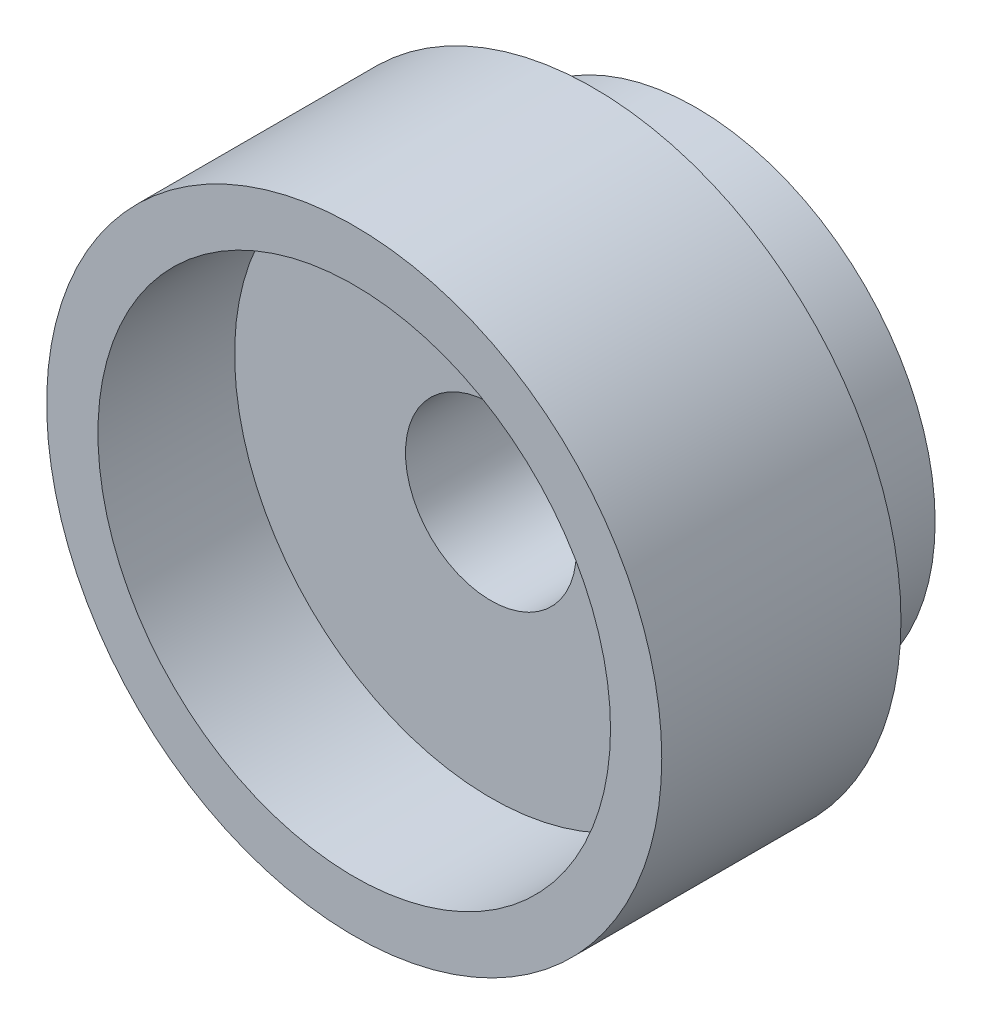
ISO-10303-21;
HEADER;
FILE_DESCRIPTION(('STEP AP214'),'2;1');
FILE_NAME('part.step','',(''),(''),'','','');
FILE_SCHEMA(('AUTOMOTIVE_DESIGN { 1 0 10303 214 1 1 1 1 }'));
ENDSEC;
DATA;
#1=APPLICATION_CONTEXT('core data for automotive mechanical design processes');
#2=APPLICATION_PROTOCOL_DEFINITION('international standard','automotive_design',2000,#1);
#3=PRODUCT_CONTEXT('',#1,'mechanical');
#4=PRODUCT('Part','Part','',(#3));
#5=PRODUCT_RELATED_PRODUCT_CATEGORY('part','',(#4));
#6=PRODUCT_DEFINITION_FORMATION('','',#4);
#7=PRODUCT_DEFINITION_CONTEXT('part definition',#1,'design');
#8=PRODUCT_DEFINITION('design','',#6,#7);
#9=PRODUCT_DEFINITION_SHAPE('','',#8);
#10=(LENGTH_UNIT() NAMED_UNIT(*) SI_UNIT(.MILLI.,.METRE.));
#11=(NAMED_UNIT(*) PLANE_ANGLE_UNIT() SI_UNIT($,.RADIAN.));
#12=(NAMED_UNIT(*) SI_UNIT($,.STERADIAN.) SOLID_ANGLE_UNIT());
#13=UNCERTAINTY_MEASURE_WITH_UNIT(LENGTH_MEASURE(1.E-05),#10,'distance_accuracy_value','');
#14=(GEOMETRIC_REPRESENTATION_CONTEXT(3) GLOBAL_UNCERTAINTY_ASSIGNED_CONTEXT((#13)) GLOBAL_UNIT_ASSIGNED_CONTEXT((#10,
#11,#12)) REPRESENTATION_CONTEXT('',''));
#15=CARTESIAN_POINT('',(0.,0.,0.));
#16=DIRECTION('',(0.,0.,1.));
#17=DIRECTION('',(1.,0.,0.));
#18=AXIS2_PLACEMENT_3D('',#15,#16,#17);
#19=CARTESIAN_POINT('',(0.,0.,20.));
#20=DIRECTION('',(0.,0.,1.));
#21=DIRECTION('',(1.,0.,0.));
#22=AXIS2_PLACEMENT_3D('',#19,#20,#21);
#23=CYLINDRICAL_SURFACE('',#22,14.);
#24=CARTESIAN_POINT('',(0.,0.,0.));
#25=DIRECTION('',(0.,0.,1.));
#26=DIRECTION('',(1.,0.,0.));
#27=AXIS2_PLACEMENT_3D('',#24,#25,#26);
#28=CIRCLE('',#27,14.);
#29=CARTESIAN_POINT('',(14.,0.,0.));
#30=VERTEX_POINT('',#29);
#31=EDGE_CURVE('E8',#30,#30,#28,.T.);
#32=ORIENTED_EDGE('',*,*,#31,.T.);
#33=EDGE_LOOP('',(#32));
#34=FACE_BOUND('',#33,.T.);
#35=CARTESIAN_POINT('',(0.,0.,6.));
#36=DIRECTION('',(0.,0.,1.));
#37=DIRECTION('',(1.,0.,0.));
#38=AXIS2_PLACEMENT_3D('',#35,#36,#37);
#39=CIRCLE('',#38,14.);
#40=CARTESIAN_POINT('',(14.,0.,6.));
#41=VERTEX_POINT('',#40);
#42=EDGE_CURVE('E25',#41,#41,#39,.T.);
#43=ORIENTED_EDGE('',*,*,#42,.F.);
#44=EDGE_LOOP('',(#43));
#45=FACE_BOUND('',#44,.T.);
#46=CARTESIAN_POINT('',(0.,14.,2.55));
#47=CARTESIAN_POINT('',(-0.0812137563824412,13.9999990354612,2.55000350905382));
#48=CARTESIAN_POINT('',(-0.162480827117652,13.9992858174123,2.55684608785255));
#49=CARTESIAN_POINT('',(-0.322760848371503,13.9965092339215,2.5840385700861));
#50=CARTESIAN_POINT('',(-0.401771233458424,13.9944443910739,2.60440325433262));
#51=CARTESIAN_POINT('',(-0.555193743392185,13.9891975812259,2.65803979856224));
#52=CARTESIAN_POINT('',(-0.629608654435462,13.9860162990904,2.69130374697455));
#53=CARTESIAN_POINT('',(-0.77178313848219,13.9788920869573,2.76977895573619));
#54=CARTESIAN_POINT('',(-0.839544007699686,13.9749493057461,2.81498788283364));
#55=CARTESIAN_POINT('',(-0.966763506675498,13.9667266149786,2.91625623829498));
#56=CARTESIAN_POINT('',(-1.02619293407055,13.9624455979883,2.97235226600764));
#57=CARTESIAN_POINT('',(-1.13481150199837,13.9540380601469,3.09372430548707));
#58=CARTESIAN_POINT('',(-1.18400016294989,13.9499115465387,3.15900074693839));
#59=CARTESIAN_POINT('',(-1.27084511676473,13.9422689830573,3.29706444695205));
#60=CARTESIAN_POINT('',(-1.3084748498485,13.9387543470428,3.36986849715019));
#61=CARTESIAN_POINT('',(-1.37096418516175,13.9327473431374,3.52080447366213));
#62=CARTESIAN_POINT('',(-1.39582412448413,13.930254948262,3.59893625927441));
#63=CARTESIAN_POINT('',(-1.43198129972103,13.9265847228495,3.75801120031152));
#64=CARTESIAN_POINT('',(-1.4433271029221,13.9254021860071,3.83894320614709));
#65=CARTESIAN_POINT('',(-1.45228409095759,13.9244709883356,4.00157070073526));
#66=CARTESIAN_POINT('',(-1.44989566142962,13.9247222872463,4.08326616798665));
#67=CARTESIAN_POINT('',(-1.43149199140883,13.9266260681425,4.244766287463));
#68=CARTESIAN_POINT('',(-1.41552984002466,13.9282730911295,4.32457706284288));
#69=CARTESIAN_POINT('',(-1.37051446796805,13.9327742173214,4.48038077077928));
#70=CARTESIAN_POINT('',(-1.3414610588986,13.9356283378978,4.55637364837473));
#71=CARTESIAN_POINT('',(-1.27102949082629,13.9422283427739,4.70255174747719));
#72=CARTESIAN_POINT('',(-1.22962784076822,13.9459759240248,4.77272557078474));
#73=CARTESIAN_POINT('',(-1.13569190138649,13.9539391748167,4.90514883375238));
#74=CARTESIAN_POINT('',(-1.08315726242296,13.9581548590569,4.96739802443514));
#75=CARTESIAN_POINT('',(-0.9681503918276,13.9666036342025,5.08251344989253));
#76=CARTESIAN_POINT('',(-0.905632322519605,13.9708367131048,5.13533390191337));
#77=CARTESIAN_POINT('',(-0.772592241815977,13.9788245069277,5.22973741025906));
#78=CARTESIAN_POINT('',(-0.702070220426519,13.9825792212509,5.27132045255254));
#79=CARTESIAN_POINT('',(-0.55499191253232,13.9891885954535,5.34206715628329));
#80=CARTESIAN_POINT('',(-0.478434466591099,13.9920430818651,5.37122842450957));
#81=CARTESIAN_POINT('',(-0.321473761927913,13.9965286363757,5.4162698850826));
#82=CARTESIAN_POINT('',(-0.241070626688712,13.9981597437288,5.43215050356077));
#83=CARTESIAN_POINT('',(-0.0790972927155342,14.0000097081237,5.45012162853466));
#84=CARTESIAN_POINT('',(0.00246582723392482,14.0002350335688,5.45227529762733));
#85=CARTESIAN_POINT('',(0.164791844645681,13.9992654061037,5.4428973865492));
#86=CARTESIAN_POINT('',(0.245554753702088,13.9980704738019,5.43136600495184));
#87=CARTESIAN_POINT('',(0.403804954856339,13.994398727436,5.39499773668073));
#88=CARTESIAN_POINT('',(0.481299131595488,13.9919247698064,5.37019049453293));
#89=CARTESIAN_POINT('',(0.631026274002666,13.9859724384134,5.30800520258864));
#90=CARTESIAN_POINT('',(0.703259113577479,13.9824940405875,5.27062685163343));
#91=CARTESIAN_POINT('',(0.840698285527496,13.9749056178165,5.18420422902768));
#92=CARTESIAN_POINT('',(0.905878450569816,13.9707933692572,5.13511854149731));
#93=CARTESIAN_POINT('',(1.02709699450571,13.9624056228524,5.02673388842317));
#94=CARTESIAN_POINT('',(1.08313512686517,13.9581301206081,4.9674346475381));
#95=CARTESIAN_POINT('',(1.18469882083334,13.9498782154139,4.84003022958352));
#96=CARTESIAN_POINT('',(1.23018287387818,13.9459030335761,4.77189187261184));
#97=CARTESIAN_POINT('',(1.30906175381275,13.9387206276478,4.6289067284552));
#98=CARTESIAN_POINT('',(1.34245675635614,13.9355133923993,4.55406003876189));
#99=CARTESIAN_POINT('',(1.39614037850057,13.9302377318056,4.39992411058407));
#100=CARTESIAN_POINT('',(1.41645352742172,13.9281671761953,4.3206434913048));
#101=CARTESIAN_POINT('',(1.44347634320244,13.9253927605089,4.15977417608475));
#102=CARTESIAN_POINT('',(1.45018643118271,13.9246888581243,4.07818555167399));
#103=CARTESIAN_POINT('',(1.44980656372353,13.9247283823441,3.91542883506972));
#104=CARTESIAN_POINT('',(1.44278181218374,13.9254649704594,3.83426058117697));
#105=CARTESIAN_POINT('',(1.41526856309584,13.9282878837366,3.67426403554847));
#106=CARTESIAN_POINT('',(1.39478005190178,13.9303742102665,3.59543574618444));
#107=CARTESIAN_POINT('',(1.34093919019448,13.9356595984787,3.44235833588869));
#108=CARTESIAN_POINT('',(1.30758891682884,13.9388584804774,3.3681084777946));
#109=CARTESIAN_POINT('',(1.22897788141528,13.9460089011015,3.22624971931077));
#110=CARTESIAN_POINT('',(1.18371715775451,13.9499604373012,3.15864079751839));
#111=CARTESIAN_POINT('',(1.08232542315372,13.9581934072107,3.03164896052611));
#112=CARTESIAN_POINT('',(1.02614580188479,13.9624762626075,2.97230494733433));
#113=CARTESIAN_POINT('',(0.904608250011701,13.9708763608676,2.86385846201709));
#114=CARTESIAN_POINT('',(0.839248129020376,13.9749935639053,2.8147584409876));
#115=CARTESIAN_POINT('',(0.701011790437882,13.9826100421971,2.7280888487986));
#116=CARTESIAN_POINT('',(0.628115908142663,13.9861076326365,2.6905505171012));
#117=CARTESIAN_POINT('',(0.477065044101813,13.9920727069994,2.62829766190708));
#118=CARTESIAN_POINT('',(0.398916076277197,13.9945413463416,2.6035687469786));
#119=CARTESIAN_POINT('',(0.26694116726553,13.9975533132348,2.57377120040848));
#120=CARTESIAN_POINT('',(0.213957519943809,13.9984665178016,2.56486926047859));
#121=CARTESIAN_POINT('',(0.107323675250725,13.9996901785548,2.55298251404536));
#122=CARTESIAN_POINT('',(0.0536734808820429,14.0000006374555,2.54999768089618));
#123=CARTESIAN_POINT('',(0.,14.,2.55));
#124=B_SPLINE_CURVE_WITH_KNOTS('',3,(#46,#47,#48,#49,#50,#51,#52,#53,#54,#55,#56,#57,#58,#59,
#60,#61,#62,#63,#64,#65,#66,#67,#68,#69,#70,#71,#72,#73,#74,#75,#76,#77,#78,#79,#80,#81,#82,#83,
#84,#85,#86,#87,#88,#89,#90,#91,#92,#93,#94,#95,#96,#97,#98,#99,#100,#101,#102,#103,#104,#105,
#106,#107,#108,#109,#110,#111,#112,#113,#114,#115,#116,#117,#118,#119,#120,#121,#122,#123),
.UNSPECIFIED.,.T.,.F.,(4,2,2,2,2,2,2,2,2,2,2,2,2,2,2,2,2,2,2,2,2,2,2,2,2,2,2,2,2,2,2,2,2,2,2,2,
2,2,4),(0.,0.243445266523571,0.487157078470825,0.730719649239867,0.974234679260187,
1.21858297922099,1.46294271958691,1.70785981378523,1.95277044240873,2.19679822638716,
2.44081915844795,2.68389005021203,2.92696444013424,3.17050423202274,3.41405167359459,
3.65875130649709,3.90345124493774,4.14819830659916,4.39293751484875,4.63654977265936,
4.88015849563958,5.12322550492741,5.36629833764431,5.61024416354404,5.85419656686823,
6.09909274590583,6.34398536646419,6.58841745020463,6.83284196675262,7.07610893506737,
7.31937614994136,7.56260409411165,7.80583125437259,8.05016713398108,8.29456140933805,
8.5396103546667,8.7843833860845,8.9452750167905,9.10616592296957),.UNSPECIFIED.);
#125=CARTESIAN_POINT('',(0.,14.,2.55));
#126=VERTEX_POINT('',#125);
#127=EDGE_CURVE('E49',#126,#126,#124,.T.);
#128=ORIENTED_EDGE('',*,*,#127,.F.);
#129=EDGE_LOOP('',(#128));
#130=FACE_BOUND('',#129,.T.);
#131=ADVANCED_FACE('F12',(#34,#45,#130),#23,.T.);
#132=CARTESIAN_POINT('',(0.,0.,20.));
#133=DIRECTION('',(0.,0.,1.));
#134=DIRECTION('',(1.,0.,0.));
#135=AXIS2_PLACEMENT_3D('',#132,#133,#134);
#136=CYLINDRICAL_SURFACE('',#135,5.);
#137=CARTESIAN_POINT('',(0.,0.,0.));
#138=DIRECTION('',(0.,0.,1.));
#139=DIRECTION('',(1.,0.,0.));
#140=AXIS2_PLACEMENT_3D('',#137,#138,#139);
#141=CIRCLE('',#140,5.);
#142=CARTESIAN_POINT('',(5.,0.,0.));
#143=VERTEX_POINT('',#142);
#144=EDGE_CURVE('E46',#143,#143,#141,.T.);
#145=ORIENTED_EDGE('',*,*,#144,.F.);
#146=EDGE_LOOP('',(#145));
#147=FACE_BOUND('',#146,.T.);
#148=CARTESIAN_POINT('',(0.,0.,12.));
#149=DIRECTION('',(0.,0.,1.));
#150=DIRECTION('',(1.,0.,0.));
#151=AXIS2_PLACEMENT_3D('',#148,#149,#150);
#152=CIRCLE('',#151,5.);
#153=CARTESIAN_POINT('',(5.,0.,12.));
#154=VERTEX_POINT('',#153);
#155=EDGE_CURVE('E43',#154,#154,#152,.T.);
#156=ORIENTED_EDGE('',*,*,#155,.T.);
#157=EDGE_LOOP('',(#156));
#158=FACE_BOUND('',#157,.T.);
#159=CARTESIAN_POINT('',(0.,5.,2.55));
#160=CARTESIAN_POINT('',(-0.0796665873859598,4.99999912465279,2.55000128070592));
#161=CARTESIAN_POINT('',(-0.15934624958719,4.99807759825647,2.55658747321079));
#162=CARTESIAN_POINT('',(-0.316392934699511,4.99059960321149,2.58270068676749));
#163=CARTESIAN_POINT('',(-0.393759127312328,4.98504184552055,2.60223229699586));
#164=CARTESIAN_POINT('',(-0.543890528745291,4.97090176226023,2.65353499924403));
#165=CARTESIAN_POINT('',(-0.616662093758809,4.962323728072,2.68528873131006));
#166=CARTESIAN_POINT('',(-0.755847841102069,4.94303928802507,2.76006521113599));
#167=CARTESIAN_POINT('',(-0.82226130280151,4.93233264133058,2.80308923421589));
#168=CARTESIAN_POINT('',(-0.948639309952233,4.90961399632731,2.90041023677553));
#169=CARTESIAN_POINT('',(-1.00840780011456,4.89757658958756,2.95495586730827));
#170=CARTESIAN_POINT('',(-1.11809017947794,4.87370819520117,3.07324131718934));
#171=CARTESIAN_POINT('',(-1.16800253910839,4.86187723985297,3.13698256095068));
#172=CARTESIAN_POINT('',(-1.25756365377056,4.83949533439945,3.27347933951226));
#173=CARTESIAN_POINT('',(-1.29697741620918,4.82897611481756,3.34639475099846));
#174=CARTESIAN_POINT('',(-1.3629051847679,4.81078656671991,3.49817262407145));
#175=CARTESIAN_POINT('',(-1.3894220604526,4.80311560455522,3.5770337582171));
#176=CARTESIAN_POINT('',(-1.42810446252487,4.79175512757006,3.73627191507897));
#177=CARTESIAN_POINT('',(-1.44062962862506,4.78796605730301,3.81655428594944));
#178=CARTESIAN_POINT('',(-1.45209558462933,4.7845017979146,3.9781633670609));
#179=CARTESIAN_POINT('',(-1.45103942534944,4.78482568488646,4.05948983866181));
#180=CARTESIAN_POINT('',(-1.43565612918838,4.78946223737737,4.21799154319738));
#181=CARTESIAN_POINT('',(-1.4217746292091,4.7936409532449,4.29521458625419));
#182=CARTESIAN_POINT('',(-1.38185274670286,4.80530031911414,4.44618512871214));
#183=CARTESIAN_POINT('',(-1.35581123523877,4.81278127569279,4.51993230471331));
#184=CARTESIAN_POINT('',(-1.29196963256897,4.83031244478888,4.66296985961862));
#185=CARTESIAN_POINT('',(-1.25402140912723,4.8403947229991,4.73219002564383));
#186=CARTESIAN_POINT('',(-1.1675466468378,4.86197654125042,4.86343153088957));
#187=CARTESIAN_POINT('',(-1.11901769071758,4.87347640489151,4.92545122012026));
#188=CARTESIAN_POINT('',(-1.01052538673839,4.89714538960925,5.04306483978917));
#189=CARTESIAN_POINT('',(-0.950190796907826,4.90932314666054,5.09831513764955));
#190=CARTESIAN_POINT('',(-0.820961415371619,4.93257808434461,5.19799055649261));
#191=CARTESIAN_POINT('',(-0.752066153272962,4.94365520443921,5.24241508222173));
#192=CARTESIAN_POINT('',(-0.607075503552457,4.96355096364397,5.31936831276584));
#193=CARTESIAN_POINT('',(-0.530939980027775,4.97235587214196,5.351825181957));
#194=CARTESIAN_POINT('',(-0.373977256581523,4.9866162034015,5.40337441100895));
#195=CARTESIAN_POINT('',(-0.293151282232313,4.99207249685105,5.42247024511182));
#196=CARTESIAN_POINT('',(-0.132026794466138,4.99888497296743,5.44619343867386));
#197=CARTESIAN_POINT('',(-0.0518023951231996,5.00037320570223,5.45128695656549));
#198=CARTESIAN_POINT('',(0.108357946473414,4.99946686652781,5.44816152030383));
#199=CARTESIAN_POINT('',(0.188293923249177,4.99707277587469,5.43994421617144));
#200=CARTESIAN_POINT('',(0.343878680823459,4.98875692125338,5.41080919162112));
#201=CARTESIAN_POINT('',(0.419582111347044,4.98290979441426,5.39016000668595));
#202=CARTESIAN_POINT('',(0.566436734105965,4.96835981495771,5.3370669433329));
#203=CARTESIAN_POINT('',(0.637587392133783,4.95965662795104,5.30462168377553));
#204=CARTESIAN_POINT('',(0.775062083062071,4.94006174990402,5.22804972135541));
#205=CARTESIAN_POINT('',(0.841244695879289,4.92912594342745,5.18368070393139));
#206=CARTESIAN_POINT('',(0.965385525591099,4.90632459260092,5.08481819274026));
#207=CARTESIAN_POINT('',(1.02334180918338,4.89445883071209,5.03032232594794));
#208=CARTESIAN_POINT('',(1.13141077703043,4.87063435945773,4.91056622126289));
#209=CARTESIAN_POINT('',(1.18119247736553,4.85868604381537,4.84500461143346));
#210=CARTESIAN_POINT('',(1.26906570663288,4.83647949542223,4.706199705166));
#211=CARTESIAN_POINT('',(1.30715761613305,4.82622120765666,4.63295665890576));
#212=CARTESIAN_POINT('',(1.37029641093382,4.80867577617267,4.48115291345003));
#213=CARTESIAN_POINT('',(1.39541026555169,4.80137342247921,4.40262192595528));
#214=CARTESIAN_POINT('',(1.4319927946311,4.79059154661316,4.24219738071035));
#215=CARTESIAN_POINT('',(1.44346576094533,4.78711082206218,4.16030488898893));
#216=CARTESIAN_POINT('',(1.45216242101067,4.7844793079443,3.99890425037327));
#217=CARTESIAN_POINT('',(1.44992316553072,4.7851653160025,3.91942730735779));
#218=CARTESIAN_POINT('',(1.43252964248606,4.79040076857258,3.76203570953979));
#219=CARTESIAN_POINT('',(1.41737583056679,4.79495007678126,3.68412099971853));
#220=CARTESIAN_POINT('',(1.37491958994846,4.80729374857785,3.53288030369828));
#221=CARTESIAN_POINT('',(1.34775051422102,4.81505243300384,3.45951375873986));
#222=CARTESIAN_POINT('',(1.2821382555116,4.83293622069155,3.31832215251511));
#223=CARTESIAN_POINT('',(1.24369302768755,4.84306175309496,3.25049809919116));
#224=CARTESIAN_POINT('',(1.15507449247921,4.86497184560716,3.1198020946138));
#225=CARTESIAN_POINT('',(1.1045442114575,4.87680139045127,3.05717972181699));
#226=CARTESIAN_POINT('',(0.993843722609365,4.9005585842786,2.94112897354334));
#227=CARTESIAN_POINT('',(0.933671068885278,4.91248625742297,2.88770293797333));
#228=CARTESIAN_POINT('',(0.803458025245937,4.93547724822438,2.79014568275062));
#229=CARTESIAN_POINT('',(0.733197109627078,4.94650899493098,2.74630063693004));
#230=CARTESIAN_POINT('',(0.585981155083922,4.96609756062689,2.6711098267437));
#231=CARTESIAN_POINT('',(0.509029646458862,4.97465567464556,2.63975751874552));
#232=CARTESIAN_POINT('',(0.360518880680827,4.98747168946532,2.59365776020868));
#233=CARTESIAN_POINT('',(0.28948194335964,4.9921324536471,2.5773284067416));
#234=CARTESIAN_POINT('',(0.145633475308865,4.99839679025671,2.55549971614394));
#235=CARTESIAN_POINT('',(0.0728222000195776,5.0000008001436,2.54999882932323));
#236=CARTESIAN_POINT('',(0.,5.,2.55));
#237=B_SPLINE_CURVE_WITH_KNOTS('',3,(#159,#160,#161,#162,#163,#164,#165,#166,#167,#168,#169,
#170,#171,#172,#173,#174,#175,#176,#177,#178,#179,#180,#181,#182,#183,#184,#185,#186,#187,#188,
#189,#190,#191,#192,#193,#194,#195,#196,#197,#198,#199,#200,#201,#202,#203,#204,#205,#206,#207,
#208,#209,#210,#211,#212,#213,#214,#215,#216,#217,#218,#219,#220,#221,#222,#223,#224,#225,#226,
#227,#228,#229,#230,#231,#232,#233,#234,#235,#236),.UNSPECIFIED.,.T.,.F.,(4,2,2,2,2,2,2,2,2,2,2,
2,2,2,2,2,2,2,2,2,2,2,2,2,2,2,2,2,2,2,2,2,2,2,2,2,2,2,4),(0.,0.238732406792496,
0.477549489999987,0.716028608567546,0.954534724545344,1.19883974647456,1.44318265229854,
1.69260621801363,1.94197426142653,2.18477351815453,2.42751823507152,2.66213329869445,
2.8967701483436,3.13445032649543,3.37218486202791,3.61916350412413,3.86615572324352,
4.11460726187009,4.36299417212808,4.60300558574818,4.84298724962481,5.07796236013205,
5.31296499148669,5.5531612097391,5.79341378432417,6.04177992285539,6.29013797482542,
6.53720132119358,6.78418691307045,7.02156263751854,7.25892998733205,7.493726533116,
7.72856568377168,7.97145803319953,8.21441209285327,8.46385133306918,8.71315974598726,
8.93141319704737,9.14963541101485),.UNSPECIFIED.);
#238=CARTESIAN_POINT('',(0.,5.,2.55));
#239=VERTEX_POINT('',#238);
#240=EDGE_CURVE('E16',#239,#239,#237,.T.);
#241=ORIENTED_EDGE('',*,*,#240,.T.);
#242=EDGE_LOOP('',(#241));
#243=FACE_BOUND('',#242,.T.);
#244=ADVANCED_FACE('F61',(#147,#158,#243),#136,.F.);
#245=CARTESIAN_POINT('',(-5.,0.,0.));
#246=DIRECTION('',(0.,0.,1.));
#247=DIRECTION('',(1.,0.,0.));
#248=AXIS2_PLACEMENT_3D('',#245,#246,#247);
#249=PLANE('',#248);
#250=ORIENTED_EDGE('',*,*,#31,.F.);
#251=EDGE_LOOP('',(#250));
#252=FACE_BOUND('',#251,.T.);
#253=ORIENTED_EDGE('',*,*,#144,.T.);
#254=EDGE_LOOP('',(#253));
#255=FACE_BOUND('',#254,.T.);
#256=ADVANCED_FACE('F14',(#252,#255),#249,.F.);
#257=CARTESIAN_POINT('',(-14.,0.,6.));
#258=DIRECTION('',(0.,0.,1.));
#259=DIRECTION('',(1.,0.,0.));
#260=AXIS2_PLACEMENT_3D('',#257,#258,#259);
#261=PLANE('',#260);
#262=CARTESIAN_POINT('',(0.,0.,6.));
#263=DIRECTION('',(0.,0.,1.));
#264=DIRECTION('',(1.,0.,0.));
#265=AXIS2_PLACEMENT_3D('',#262,#263,#264);
#266=CIRCLE('',#265,18.);
#267=CARTESIAN_POINT('',(18.,0.,6.));
#268=VERTEX_POINT('',#267);
#269=EDGE_CURVE('E29',#268,#268,#266,.T.);
#270=ORIENTED_EDGE('',*,*,#269,.F.);
#271=EDGE_LOOP('',(#270));
#272=FACE_BOUND('',#271,.T.);
#273=ORIENTED_EDGE('',*,*,#42,.T.);
#274=EDGE_LOOP('',(#273));
#275=FACE_BOUND('',#274,.T.);
#276=ADVANCED_FACE('F80',(#272,#275),#261,.F.);
#277=CARTESIAN_POINT('',(0.,0.,20.));
#278=DIRECTION('',(0.,0.,1.));
#279=DIRECTION('',(1.,0.,0.));
#280=AXIS2_PLACEMENT_3D('',#277,#278,#279);
#281=CYLINDRICAL_SURFACE('',#280,18.);
#282=ORIENTED_EDGE('',*,*,#269,.T.);
#283=EDGE_LOOP('',(#282));
#284=FACE_BOUND('',#283,.T.);
#285=CARTESIAN_POINT('',(0.,0.,20.));
#286=DIRECTION('',(0.,0.,1.));
#287=DIRECTION('',(1.,0.,0.));
#288=AXIS2_PLACEMENT_3D('',#285,#286,#287);
#289=CIRCLE('',#288,18.);
#290=CARTESIAN_POINT('',(18.,0.,20.));
#291=VERTEX_POINT('',#290);
#292=EDGE_CURVE('E34',#291,#291,#289,.T.);
#293=ORIENTED_EDGE('',*,*,#292,.F.);
#294=EDGE_LOOP('',(#293));
#295=FACE_BOUND('',#294,.T.);
#296=ADVANCED_FACE('F77',(#284,#295),#281,.T.);
#297=CARTESIAN_POINT('',(-15.,0.,20.));
#298=DIRECTION('',(0.,0.,1.));
#299=DIRECTION('',(1.,0.,0.));
#300=AXIS2_PLACEMENT_3D('',#297,#298,#299);
#301=PLANE('',#300);
#302=ORIENTED_EDGE('',*,*,#292,.T.);
#303=EDGE_LOOP('',(#302));
#304=FACE_BOUND('',#303,.T.);
#305=CARTESIAN_POINT('',(0.,0.,20.));
#306=DIRECTION('',(0.,0.,1.));
#307=DIRECTION('',(1.,0.,0.));
#308=AXIS2_PLACEMENT_3D('',#305,#306,#307);
#309=CIRCLE('',#308,15.);
#310=CARTESIAN_POINT('',(15.,0.,20.));
#311=VERTEX_POINT('',#310);
#312=EDGE_CURVE('E37',#311,#311,#309,.T.);
#313=ORIENTED_EDGE('',*,*,#312,.F.);
#314=EDGE_LOOP('',(#313));
#315=FACE_BOUND('',#314,.T.);
#316=ADVANCED_FACE('F73',(#304,#315),#301,.T.);
#317=CARTESIAN_POINT('',(0.,0.,20.));
#318=DIRECTION('',(0.,0.,1.));
#319=DIRECTION('',(1.,0.,0.));
#320=AXIS2_PLACEMENT_3D('',#317,#318,#319);
#321=CYLINDRICAL_SURFACE('',#320,15.);
#322=ORIENTED_EDGE('',*,*,#312,.T.);
#323=EDGE_LOOP('',(#322));
#324=FACE_BOUND('',#323,.T.);
#325=CARTESIAN_POINT('',(0.,0.,12.));
#326=DIRECTION('',(0.,0.,1.));
#327=DIRECTION('',(1.,0.,0.));
#328=AXIS2_PLACEMENT_3D('',#325,#326,#327);
#329=CIRCLE('',#328,15.);
#330=CARTESIAN_POINT('',(15.,0.,12.));
#331=VERTEX_POINT('',#330);
#332=EDGE_CURVE('E40',#331,#331,#329,.T.);
#333=ORIENTED_EDGE('',*,*,#332,.F.);
#334=EDGE_LOOP('',(#333));
#335=FACE_BOUND('',#334,.T.);
#336=ADVANCED_FACE('F69',(#324,#335),#321,.F.);
#337=CARTESIAN_POINT('',(-5.,0.,12.));
#338=DIRECTION('',(0.,0.,1.));
#339=DIRECTION('',(1.,0.,0.));
#340=AXIS2_PLACEMENT_3D('',#337,#338,#339);
#341=PLANE('',#340);
#342=ORIENTED_EDGE('',*,*,#332,.T.);
#343=EDGE_LOOP('',(#342));
#344=FACE_BOUND('',#343,.T.);
#345=ORIENTED_EDGE('',*,*,#155,.F.);
#346=EDGE_LOOP('',(#345));
#347=FACE_BOUND('',#346,.T.);
#348=ADVANCED_FACE('F59',(#344,#347),#341,.T.);
#349=CARTESIAN_POINT('',(0.,20.,4.));
#350=DIRECTION('',(0.,-1.,0.));
#351=DIRECTION('',(0.,0.,-1.));
#352=AXIS2_PLACEMENT_3D('',#349,#350,#351);
#353=CYLINDRICAL_SURFACE('',#352,1.45);
#354=ORIENTED_EDGE('',*,*,#240,.F.);
#355=EDGE_LOOP('',(#354));
#356=FACE_BOUND('',#355,.T.);
#357=ORIENTED_EDGE('',*,*,#127,.T.);
#358=EDGE_LOOP('',(#357));
#359=FACE_BOUND('',#358,.T.);
#360=ADVANCED_FACE('F56',(#356,#359),#353,.F.);
#361=CLOSED_SHELL('',(#131,#244,#256,#276,#296,#316,#336,#348,#360));
#362=MANIFOLD_SOLID_BREP('B1',#361);
#363=ADVANCED_BREP_SHAPE_REPRESENTATION('',(#18,#362),#14);
#364=SHAPE_DEFINITION_REPRESENTATION(#9,#363);
ENDSEC;
END-ISO-10303-21;
